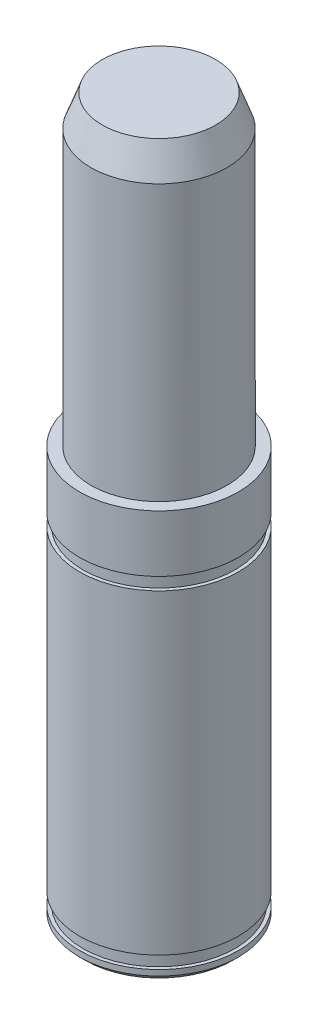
from build123d import *

# Parameters (mm, degrees)
CHANFREIN1_SIZE  = 2.75
CHANFREIN1_SIZE2 = 1.000918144
CHANFREIN2_SIZE  = 0.5


with BuildPart() as part:
    # Esquisse1 → Base-R_volution (revolve)
    with BuildSketch(Plane.XY, mode=Mode.PRIVATE) as base_r_volution_sk:
        Polygon((0, 27), (6, 27), (6, 0), (7, 0), (7, -5), (6.7, -5), (6.7, -6.1), (7, -6.1), (7, -33.9), (6.7, -33.9), (6.7, -35), (7, -35), (7, -36), (0, -36), align=None)
    revolve(base_r_volution_sk.sketch.rotate(Axis((0, 78.428070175, 0), (0, -1, 0)), 90), axis=Axis((0, 78.428070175, 0), (0, -1, 0)))

    # Chanfrein1
    chanfrein1_edges = [part.edges().sort_by_distance(p)[0] for p in [
        (0, 27, -6),
    ]]
    chanfrein1_side = [part.faces().sort_by_distance(p)[0] for p in [
        (0, 13.5, -6),
    ]]
    chamfer(chanfrein1_edges, length=CHANFREIN1_SIZE, length2=CHANFREIN1_SIZE2, reference=chanfrein1_side[0])

    # Chanfrein2
    chanfrein2_edges = [part.edges().sort_by_distance(p)[0] for p in [
        (0, -36, -7),
    ]]
    chamfer(chanfrein2_edges, length=CHANFREIN2_SIZE)


solid = part.part
